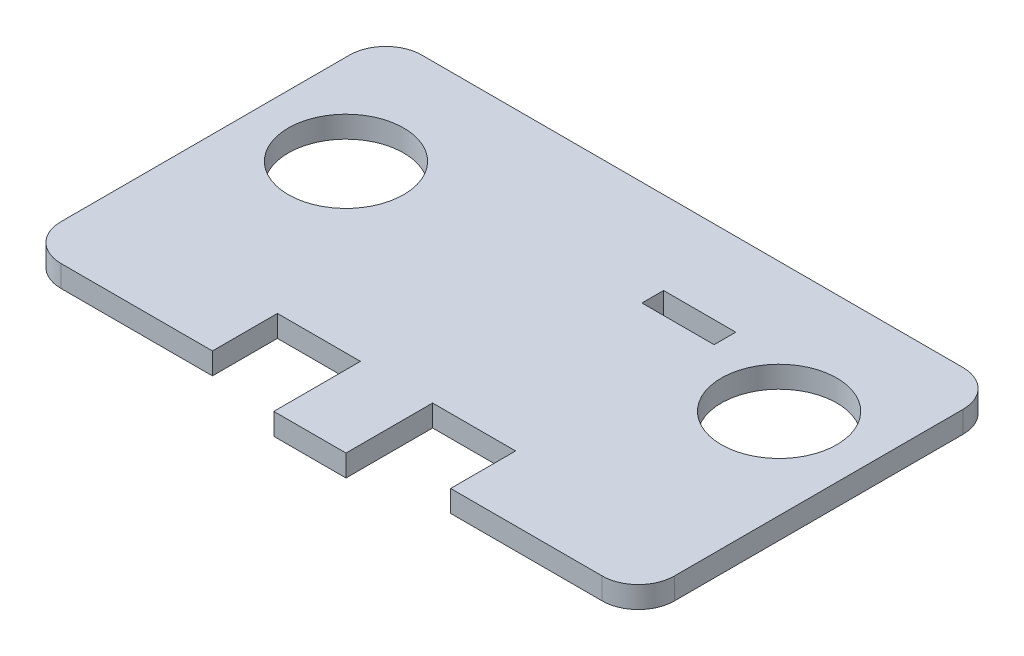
from build123d import *

# Parameters (mm, degrees)
SKETCH1_W           = 85
SKETCH1_H           = 50
BOSS_EXTRUDE1_DEPTH = 3
FILLET1_R           = 5
SKETCH2_R           = 8
CUT_EXTRUDE1_DEPTH  = 3
SKETCH4_W           = 16.5
SKETCH4_H           = 9
CUT_EXTRUDE2_DEPTH  = 3
SKETCH6_W           = 10
SKETCH6_H           = 12
BOSS_EXTRUDE2_DEPTH = 3
SKETCH7_W           = 10
SKETCH7_H           = 3
CUT_EXTRUDE3_DEPTH  = 3


with BuildPart() as part:
    # Sketch1 → Boss-Extrude1 (new body)
    with BuildSketch(Plane(origin=(0, 0, 0), x_dir=(1, 0, 0), z_dir=(0, 1, 0))):
        Rectangle(SKETCH1_W, SKETCH1_H)
    extrude(amount=BOSS_EXTRUDE1_DEPTH)

    # Fillet1
    fillet1_edges = [part.edges().sort_by_distance(p)[0] for p in [
        (42.5, 1.5, 25),
        (-42.5, 1.5, 25),
        (-42.5, 1.5, -25),
        (42.5, 1.5, -25),
    ]]
    fillet(fillet1_edges, radius=FILLET1_R)

    # Sketch2 → Cut-Extrude1 (cut)
    with BuildSketch(Plane(origin=(0, 3, 0), x_dir=(1, 0, 0), z_dir=(0, 1, 0))):
        with Locations(Location((-30, 7, 0), (0, 0, 270))):
            Circle(SKETCH2_R)
        with Locations(Location((30, 7, 0), (0, 0, 270))):
            Circle(SKETCH2_R)
    extrude(amount=-CUT_EXTRUDE1_DEPTH, mode=Mode.SUBTRACT)

    # Sketch4 → Cut-Extrude2 (cut)
    with BuildSketch(Plane(origin=(0, 3, 0), x_dir=(1, 0, 0), z_dir=(0, 1, 0))):
        with Locations((-8.25, -20.5)):
            Rectangle(SKETCH4_W, SKETCH4_H)
    cut_extrude2 = extrude(amount=-CUT_EXTRUDE2_DEPTH, mode=Mode.SUBTRACT)

    # Mirror1: Cut-Extrude2 across plane
    add(cut_extrude2.mirror(Plane(origin=(0, 0, 0), x_dir=(0, 0, 1), z_dir=(1, 0, 0))), mode=Mode.SUBTRACT)

    # Sketch6 → Boss-Extrude2 (add)
    with BuildSketch(Plane(origin=(0, 3, 0), x_dir=(1, 0, 0), z_dir=(0, 1, 0))):
        with Locations((0, -22)):
            Rectangle(SKETCH6_W, SKETCH6_H)
    extrude(amount=-BOSS_EXTRUDE2_DEPTH)

    # Sketch7 → Cut-Extrude3 (cut)
    with BuildSketch(Plane(origin=(0, 3, 0), x_dir=(1, 0, 0), z_dir=(0, 1, 0))):
        with Locations((12.5, 12)):
            Rectangle(SKETCH7_W, SKETCH7_H)
    extrude(amount=-CUT_EXTRUDE3_DEPTH, mode=Mode.SUBTRACT)


solid = part.part
